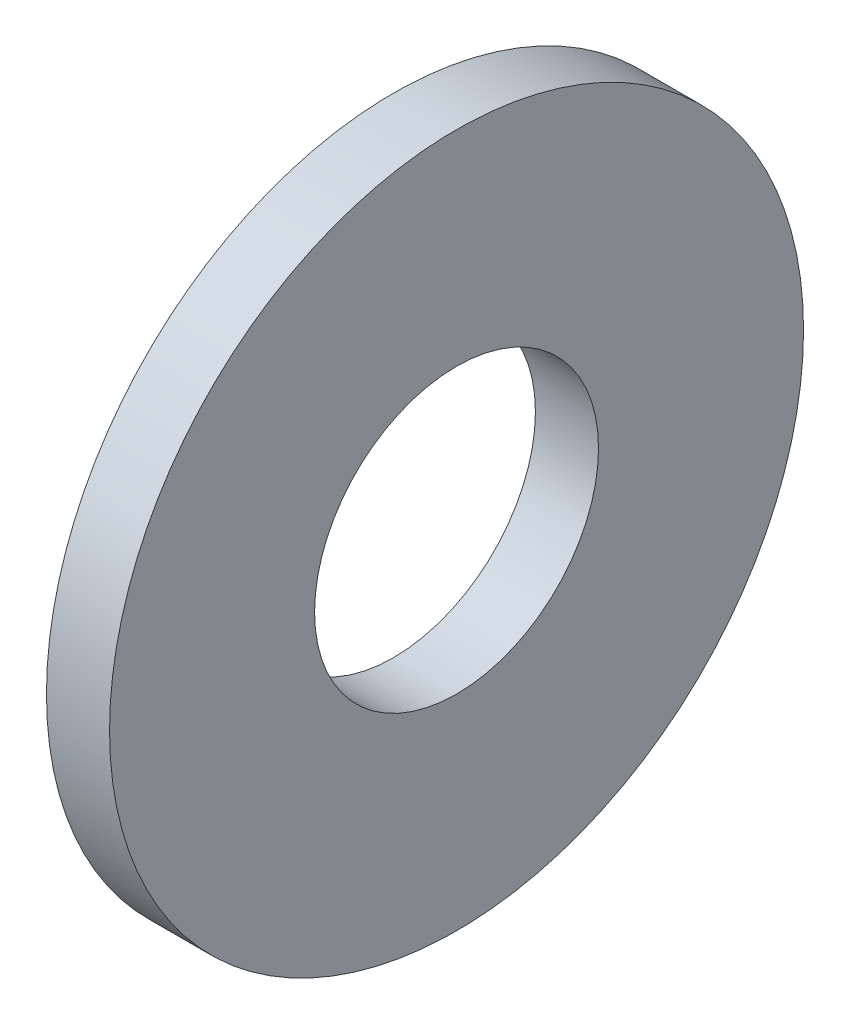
ISO-10303-21;
HEADER;
FILE_DESCRIPTION(('STEP AP214'),'2;1');
FILE_NAME('part.step','',(''),(''),'','','');
FILE_SCHEMA(('AUTOMOTIVE_DESIGN { 1 0 10303 214 1 1 1 1 }'));
ENDSEC;
DATA;
#1=APPLICATION_CONTEXT('core data for automotive mechanical design processes');
#2=APPLICATION_PROTOCOL_DEFINITION('international standard','automotive_design',2000,#1);
#3=PRODUCT_CONTEXT('',#1,'mechanical');
#4=PRODUCT('Part','Part','',(#3));
#5=PRODUCT_RELATED_PRODUCT_CATEGORY('part','',(#4));
#6=PRODUCT_DEFINITION_FORMATION('','',#4);
#7=PRODUCT_DEFINITION_CONTEXT('part definition',#1,'design');
#8=PRODUCT_DEFINITION('design','',#6,#7);
#9=PRODUCT_DEFINITION_SHAPE('','',#8);
#10=(LENGTH_UNIT() NAMED_UNIT(*) SI_UNIT(.MILLI.,.METRE.));
#11=(NAMED_UNIT(*) PLANE_ANGLE_UNIT() SI_UNIT($,.RADIAN.));
#12=(NAMED_UNIT(*) SI_UNIT($,.STERADIAN.) SOLID_ANGLE_UNIT());
#13=UNCERTAINTY_MEASURE_WITH_UNIT(LENGTH_MEASURE(1.E-05),#10,'distance_accuracy_value','');
#14=(GEOMETRIC_REPRESENTATION_CONTEXT(3) GLOBAL_UNCERTAINTY_ASSIGNED_CONTEXT((#13)) GLOBAL_UNIT_ASSIGNED_CONTEXT((#10,
#11,#12)) REPRESENTATION_CONTEXT('',''));
#15=CARTESIAN_POINT('',(0.,0.,0.));
#16=DIRECTION('',(0.,0.,1.));
#17=DIRECTION('',(1.,0.,0.));
#18=AXIS2_PLACEMENT_3D('',#15,#16,#17);
#19=CARTESIAN_POINT('',(-7.4558363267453,0.,0.));
#20=DIRECTION('',(-1.,0.,0.));
#21=DIRECTION('',(0.,0.,1.));
#22=AXIS2_PLACEMENT_3D('',#19,#20,#21);
#23=CYLINDRICAL_SURFACE('',#22,5.5);
#24=CARTESIAN_POINT('',(0.,0.,0.));
#25=DIRECTION('',(-1.,0.,0.));
#26=DIRECTION('',(0.,0.,1.));
#27=AXIS2_PLACEMENT_3D('',#24,#25,#26);
#28=CIRCLE('',#27,5.5);
#29=CARTESIAN_POINT('',(0.,0.,5.5));
#30=VERTEX_POINT('',#29);
#31=EDGE_CURVE('E43',#30,#30,#28,.T.);
#32=ORIENTED_EDGE('',*,*,#31,.F.);
#33=EDGE_LOOP('',(#32));
#34=FACE_BOUND('',#33,.T.);
#35=CARTESIAN_POINT('',(1.,0.,0.));
#36=DIRECTION('',(-1.,0.,0.));
#37=DIRECTION('',(0.,0.,1.));
#38=AXIS2_PLACEMENT_3D('',#35,#36,#37);
#39=CIRCLE('',#38,5.5);
#40=CARTESIAN_POINT('',(1.,0.,5.5));
#41=VERTEX_POINT('',#40);
#42=EDGE_CURVE('E10',#41,#41,#39,.T.);
#43=ORIENTED_EDGE('',*,*,#42,.T.);
#44=EDGE_LOOP('',(#43));
#45=FACE_BOUND('',#44,.T.);
#46=ADVANCED_FACE('F29',(#34,#45),#23,.T.);
#47=CARTESIAN_POINT('',(1.,5.5,0.));
#48=DIRECTION('',(-1.,0.,0.));
#49=DIRECTION('',(0.,0.,1.));
#50=AXIS2_PLACEMENT_3D('',#47,#48,#49);
#51=PLANE('',#50);
#52=ORIENTED_EDGE('',*,*,#42,.F.);
#53=EDGE_LOOP('',(#52));
#54=FACE_BOUND('',#53,.T.);
#55=CARTESIAN_POINT('',(1.,0.,0.));
#56=DIRECTION('',(-1.,0.,0.));
#57=DIRECTION('',(0.,0.,1.));
#58=AXIS2_PLACEMENT_3D('',#55,#56,#57);
#59=CIRCLE('',#58,2.25);
#60=CARTESIAN_POINT('',(1.,0.,2.25));
#61=VERTEX_POINT('',#60);
#62=EDGE_CURVE('E35',#61,#61,#59,.T.);
#63=ORIENTED_EDGE('',*,*,#62,.T.);
#64=EDGE_LOOP('',(#63));
#65=FACE_BOUND('',#64,.T.);
#66=ADVANCED_FACE('F52',(#54,#65),#51,.F.);
#67=CARTESIAN_POINT('',(-7.4558363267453,0.,0.));
#68=DIRECTION('',(-1.,0.,0.));
#69=DIRECTION('',(0.,0.,1.));
#70=AXIS2_PLACEMENT_3D('',#67,#68,#69);
#71=CYLINDRICAL_SURFACE('',#70,2.25);
#72=ORIENTED_EDGE('',*,*,#62,.F.);
#73=EDGE_LOOP('',(#72));
#74=FACE_BOUND('',#73,.T.);
#75=CARTESIAN_POINT('',(0.,0.,0.));
#76=DIRECTION('',(-1.,0.,0.));
#77=DIRECTION('',(0.,0.,1.));
#78=AXIS2_PLACEMENT_3D('',#75,#76,#77);
#79=CIRCLE('',#78,2.25);
#80=CARTESIAN_POINT('',(0.,0.,2.25));
#81=VERTEX_POINT('',#80);
#82=EDGE_CURVE('E39',#81,#81,#79,.T.);
#83=ORIENTED_EDGE('',*,*,#82,.T.);
#84=EDGE_LOOP('',(#83));
#85=FACE_BOUND('',#84,.T.);
#86=ADVANCED_FACE('F56',(#74,#85),#71,.F.);
#87=CARTESIAN_POINT('',(0.,2.25,0.));
#88=DIRECTION('',(1.,0.,0.));
#89=DIRECTION('',(0.,0.,-1.));
#90=AXIS2_PLACEMENT_3D('',#87,#88,#89);
#91=PLANE('',#90);
#92=ORIENTED_EDGE('',*,*,#82,.F.);
#93=EDGE_LOOP('',(#92));
#94=FACE_BOUND('',#93,.T.);
#95=ORIENTED_EDGE('',*,*,#31,.T.);
#96=EDGE_LOOP('',(#95));
#97=FACE_BOUND('',#96,.T.);
#98=ADVANCED_FACE('F49',(#94,#97),#91,.F.);
#99=CLOSED_SHELL('',(#46,#66,#86,#98));
#100=MANIFOLD_SOLID_BREP('B2',#99);
#101=ADVANCED_BREP_SHAPE_REPRESENTATION('',(#18,#100),#14);
#102=SHAPE_DEFINITION_REPRESENTATION(#9,#101);
ENDSEC;
END-ISO-10303-21;
